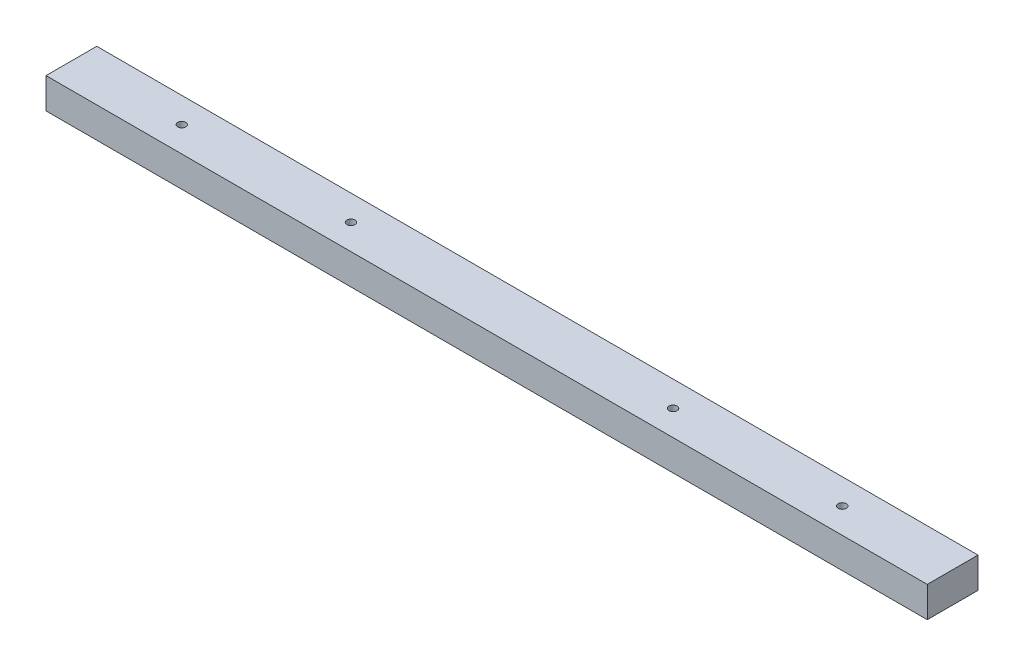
ISO-10303-21;
HEADER;
FILE_DESCRIPTION(('STEP AP214'),'2;1');
FILE_NAME('part.step','',(''),(''),'','','');
FILE_SCHEMA(('AUTOMOTIVE_DESIGN { 1 0 10303 214 1 1 1 1 }'));
ENDSEC;
DATA;
#1=APPLICATION_CONTEXT('core data for automotive mechanical design processes');
#2=APPLICATION_PROTOCOL_DEFINITION('international standard','automotive_design',2000,#1);
#3=PRODUCT_CONTEXT('',#1,'mechanical');
#4=PRODUCT('Part','Part','',(#3));
#5=PRODUCT_RELATED_PRODUCT_CATEGORY('part','',(#4));
#6=PRODUCT_DEFINITION_FORMATION('','',#4);
#7=PRODUCT_DEFINITION_CONTEXT('part definition',#1,'design');
#8=PRODUCT_DEFINITION('design','',#6,#7);
#9=PRODUCT_DEFINITION_SHAPE('','',#8);
#10=(LENGTH_UNIT() NAMED_UNIT(*) SI_UNIT(.MILLI.,.METRE.));
#11=(NAMED_UNIT(*) PLANE_ANGLE_UNIT() SI_UNIT($,.RADIAN.));
#12=(NAMED_UNIT(*) SI_UNIT($,.STERADIAN.) SOLID_ANGLE_UNIT());
#13=UNCERTAINTY_MEASURE_WITH_UNIT(LENGTH_MEASURE(1.E-05),#10,'distance_accuracy_value','');
#14=(GEOMETRIC_REPRESENTATION_CONTEXT(3) GLOBAL_UNCERTAINTY_ASSIGNED_CONTEXT((#13)) GLOBAL_UNIT_ASSIGNED_CONTEXT((#10,
#11,#12)) REPRESENTATION_CONTEXT('',''));
#15=CARTESIAN_POINT('',(0.,0.,0.));
#16=DIRECTION('',(0.,0.,1.));
#17=DIRECTION('',(1.,0.,0.));
#18=AXIS2_PLACEMENT_3D('',#15,#16,#17);
#19=CARTESIAN_POINT('',(0.,38.,0.));
#20=DIRECTION('',(0.,0.,-1.));
#21=DIRECTION('',(-1.,0.,0.));
#22=AXIS2_PLACEMENT_3D('',#19,#20,#21);
#23=PLANE('',#22);
#24=DIRECTION('',(1.,0.,0.));
#25=VECTOR('',#24,1.);
#26=CARTESIAN_POINT('',(0.,38.,0.));
#27=LINE('',#26,#25);
#28=CARTESIAN_POINT('',(63.,38.,0.));
#29=VERTEX_POINT('',#28);
#30=CARTESIAN_POINT('',(1157.,38.,-1.3397635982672E-13));
#31=VERTEX_POINT('',#30);
#32=EDGE_CURVE('E40',#29,#31,#27,.T.);
#33=ORIENTED_EDGE('',*,*,#32,.F.);
#34=DIRECTION('',(0.,1.,0.));
#35=VECTOR('',#34,1.);
#36=CARTESIAN_POINT('',(63.,-0.001000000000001,0.));
#37=LINE('',#36,#35);
#38=CARTESIAN_POINT('',(63.,0.,0.));
#39=VERTEX_POINT('',#38);
#40=EDGE_CURVE('E72',#39,#29,#37,.T.);
#41=ORIENTED_EDGE('',*,*,#40,.F.);
#42=DIRECTION('',(1.,0.,0.));
#43=VECTOR('',#42,1.);
#44=CARTESIAN_POINT('',(0.,0.,0.));
#45=LINE('',#44,#43);
#46=CARTESIAN_POINT('',(1157.,0.,0.));
#47=VERTEX_POINT('',#46);
#48=EDGE_CURVE('E90',#39,#47,#45,.T.);
#49=ORIENTED_EDGE('',*,*,#48,.T.);
#50=DIRECTION('',(0.,1.,0.));
#51=VECTOR('',#50,1.);
#52=CARTESIAN_POINT('',(1157.,-0.001000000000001,-1.3397635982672E-13));
#53=LINE('',#52,#51);
#54=EDGE_CURVE('E48',#47,#31,#53,.T.);
#55=ORIENTED_EDGE('',*,*,#54,.T.);
#56=EDGE_LOOP('',(#33,#41,#49,#55));
#57=FACE_BOUND('',#56,.T.);
#58=ADVANCED_FACE('F32',(#57),#23,.F.);
#59=CARTESIAN_POINT('',(0.,38.,-63.));
#60=DIRECTION('',(0.,0.,1.));
#61=DIRECTION('',(1.,0.,0.));
#62=AXIS2_PLACEMENT_3D('',#59,#60,#61);
#63=PLANE('',#62);
#64=DIRECTION('',(-1.,0.,0.));
#65=VECTOR('',#64,1.);
#66=CARTESIAN_POINT('',(0.,0.,-63.));
#67=LINE('',#66,#65);
#68=CARTESIAN_POINT('',(1157.,0.,-63.0000000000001));
#69=VERTEX_POINT('',#68);
#70=CARTESIAN_POINT('',(63.,0.,-63.));
#71=VERTEX_POINT('',#70);
#72=EDGE_CURVE('E35',#69,#71,#67,.T.);
#73=ORIENTED_EDGE('',*,*,#72,.T.);
#74=DIRECTION('',(0.,1.,0.));
#75=VECTOR('',#74,1.);
#76=CARTESIAN_POINT('',(63.,-0.001000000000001,-63.));
#77=LINE('',#76,#75);
#78=CARTESIAN_POINT('',(63.,38.,-63.));
#79=VERTEX_POINT('',#78);
#80=EDGE_CURVE('E56',#71,#79,#77,.T.);
#81=ORIENTED_EDGE('',*,*,#80,.T.);
#82=DIRECTION('',(-1.,0.,0.));
#83=VECTOR('',#82,1.);
#84=CARTESIAN_POINT('',(0.,38.,-63.));
#85=LINE('',#84,#83);
#86=CARTESIAN_POINT('',(1157.,38.,-63.0000000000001));
#87=VERTEX_POINT('',#86);
#88=EDGE_CURVE('E11',#87,#79,#85,.T.);
#89=ORIENTED_EDGE('',*,*,#88,.F.);
#90=DIRECTION('',(0.,1.,0.));
#91=VECTOR('',#90,1.);
#92=CARTESIAN_POINT('',(1157.,-0.001000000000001,-63.0000000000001));
#93=LINE('',#92,#91);
#94=EDGE_CURVE('E104',#69,#87,#93,.T.);
#95=ORIENTED_EDGE('',*,*,#94,.F.);
#96=EDGE_LOOP('',(#73,#81,#89,#95));
#97=FACE_BOUND('',#96,.T.);
#98=ADVANCED_FACE('F134',(#97),#63,.F.);
#99=CARTESIAN_POINT('',(0.,38.,0.));
#100=DIRECTION('',(0.,-1.,0.));
#101=DIRECTION('',(0.,0.,-1.));
#102=AXIS2_PLACEMENT_3D('',#99,#100,#101);
#103=PLANE('',#102);
#104=CARTESIAN_POINT('',(200.,38.,-31.5));
#105=DIRECTION('',(0.,1.,0.));
#106=DIRECTION('',(0.,0.,1.));
#107=AXIS2_PLACEMENT_3D('',#104,#105,#106);
#108=CIRCLE('',#107,4.99999999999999);
#109=CARTESIAN_POINT('',(200.,38.,-26.5));
#110=VERTEX_POINT('',#109);
#111=EDGE_CURVE('E96',#110,#110,#108,.T.);
#112=ORIENTED_EDGE('',*,*,#111,.F.);
#113=EDGE_LOOP('',(#112));
#114=FACE_BOUND('',#113,.T.);
#115=CARTESIAN_POINT('',(410.,38.,-31.5));
#116=DIRECTION('',(0.,1.,0.));
#117=DIRECTION('',(0.,0.,1.));
#118=AXIS2_PLACEMENT_3D('',#115,#116,#117);
#119=CIRCLE('',#118,5.00000000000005);
#120=CARTESIAN_POINT('',(410.,38.,-26.5));
#121=VERTEX_POINT('',#120);
#122=EDGE_CURVE('E109',#121,#121,#119,.T.);
#123=ORIENTED_EDGE('',*,*,#122,.F.);
#124=EDGE_LOOP('',(#123));
#125=FACE_BOUND('',#124,.T.);
#126=CARTESIAN_POINT('',(810.,38.,-31.5));
#127=DIRECTION('',(0.,1.,0.));
#128=DIRECTION('',(0.,0.,-1.));
#129=AXIS2_PLACEMENT_3D('',#126,#127,#128);
#130=CIRCLE('',#129,5.00000000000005);
#131=CARTESIAN_POINT('',(810.,38.,-36.5));
#132=VERTEX_POINT('',#131);
#133=EDGE_CURVE('E115',#132,#132,#130,.T.);
#134=ORIENTED_EDGE('',*,*,#133,.F.);
#135=EDGE_LOOP('',(#134));
#136=FACE_BOUND('',#135,.T.);
#137=CARTESIAN_POINT('',(1020.,38.,-31.5000000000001));
#138=DIRECTION('',(0.,1.,0.));
#139=DIRECTION('',(0.,0.,-1.));
#140=AXIS2_PLACEMENT_3D('',#137,#138,#139);
#141=CIRCLE('',#140,5.00000000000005);
#142=CARTESIAN_POINT('',(1020.,38.,-36.5000000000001));
#143=VERTEX_POINT('',#142);
#144=EDGE_CURVE('E92',#143,#143,#141,.T.);
#145=ORIENTED_EDGE('',*,*,#144,.F.);
#146=EDGE_LOOP('',(#145));
#147=FACE_BOUND('',#146,.T.);
#148=ORIENTED_EDGE('',*,*,#88,.T.);
#149=DIRECTION('',(0.,0.,-1.));
#150=VECTOR('',#149,1.);
#151=CARTESIAN_POINT('',(63.,38.,0.));
#152=LINE('',#151,#150);
#153=EDGE_CURVE('E75',#29,#79,#152,.T.);
#154=ORIENTED_EDGE('',*,*,#153,.F.);
#155=ORIENTED_EDGE('',*,*,#32,.T.);
#156=DIRECTION('',(0.,0.,1.));
#157=VECTOR('',#156,1.);
#158=CARTESIAN_POINT('',(1157.,38.,-1.3397635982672E-13));
#159=LINE('',#158,#157);
#160=EDGE_CURVE('E130',#87,#31,#159,.T.);
#161=ORIENTED_EDGE('',*,*,#160,.F.);
#162=EDGE_LOOP('',(#148,#154,#155,#161));
#163=FACE_BOUND('',#162,.T.);
#164=ADVANCED_FACE('F84',(#114,#125,#136,#147,#163),#103,.F.);
#165=CARTESIAN_POINT('',(0.,0.,0.));
#166=DIRECTION('',(0.,-1.,0.));
#167=DIRECTION('',(0.,0.,-1.));
#168=AXIS2_PLACEMENT_3D('',#165,#166,#167);
#169=PLANE('',#168);
#170=DIRECTION('',(0.,0.,-1.));
#171=VECTOR('',#170,1.);
#172=CARTESIAN_POINT('',(63.,0.,0.));
#173=LINE('',#172,#171);
#174=EDGE_CURVE('E76',#39,#71,#173,.T.);
#175=ORIENTED_EDGE('',*,*,#174,.T.);
#176=ORIENTED_EDGE('',*,*,#72,.F.);
#177=DIRECTION('',(0.,0.,1.));
#178=VECTOR('',#177,1.);
#179=CARTESIAN_POINT('',(1157.,0.,-1.3397635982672E-13));
#180=LINE('',#179,#178);
#181=EDGE_CURVE('E128',#69,#47,#180,.T.);
#182=ORIENTED_EDGE('',*,*,#181,.T.);
#183=ORIENTED_EDGE('',*,*,#48,.F.);
#184=EDGE_LOOP('',(#175,#176,#182,#183));
#185=FACE_BOUND('',#184,.T.);
#186=CARTESIAN_POINT('',(200.,0.,-31.5));
#187=DIRECTION('',(0.,1.,0.));
#188=DIRECTION('',(0.,0.,1.));
#189=AXIS2_PLACEMENT_3D('',#186,#187,#188);
#190=CIRCLE('',#189,4.99999999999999);
#191=CARTESIAN_POINT('',(200.,0.,-26.5));
#192=VERTEX_POINT('',#191);
#193=EDGE_CURVE('E94',#192,#192,#190,.T.);
#194=ORIENTED_EDGE('',*,*,#193,.T.);
#195=EDGE_LOOP('',(#194));
#196=FACE_BOUND('',#195,.T.);
#197=CARTESIAN_POINT('',(410.,0.,-31.5));
#198=DIRECTION('',(0.,1.,0.));
#199=DIRECTION('',(0.,0.,1.));
#200=AXIS2_PLACEMENT_3D('',#197,#198,#199);
#201=CIRCLE('',#200,5.00000000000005);
#202=CARTESIAN_POINT('',(410.,0.,-26.5));
#203=VERTEX_POINT('',#202);
#204=EDGE_CURVE('E101',#203,#203,#201,.T.);
#205=ORIENTED_EDGE('',*,*,#204,.T.);
#206=EDGE_LOOP('',(#205));
#207=FACE_BOUND('',#206,.T.);
#208=CARTESIAN_POINT('',(810.,0.,-31.5));
#209=DIRECTION('',(0.,1.,0.));
#210=DIRECTION('',(0.,0.,-1.));
#211=AXIS2_PLACEMENT_3D('',#208,#209,#210);
#212=CIRCLE('',#211,5.00000000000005);
#213=CARTESIAN_POINT('',(810.,0.,-36.5));
#214=VERTEX_POINT('',#213);
#215=EDGE_CURVE('E112',#214,#214,#212,.T.);
#216=ORIENTED_EDGE('',*,*,#215,.T.);
#217=EDGE_LOOP('',(#216));
#218=FACE_BOUND('',#217,.T.);
#219=CARTESIAN_POINT('',(1020.,0.,-31.5000000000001));
#220=DIRECTION('',(0.,1.,0.));
#221=DIRECTION('',(0.,0.,-1.));
#222=AXIS2_PLACEMENT_3D('',#219,#220,#221);
#223=CIRCLE('',#222,5.00000000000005);
#224=CARTESIAN_POINT('',(1020.,0.,-36.5000000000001));
#225=VERTEX_POINT('',#224);
#226=EDGE_CURVE('E117',#225,#225,#223,.T.);
#227=ORIENTED_EDGE('',*,*,#226,.T.);
#228=EDGE_LOOP('',(#227));
#229=FACE_BOUND('',#228,.T.);
#230=ADVANCED_FACE('F140',(#185,#196,#207,#218,#229),#169,.T.);
#231=CARTESIAN_POINT('',(1020.,0.,-31.5000000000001));
#232=DIRECTION('',(0.,1.,0.));
#233=DIRECTION('',(0.,0.,1.));
#234=AXIS2_PLACEMENT_3D('',#231,#232,#233);
#235=CYLINDRICAL_SURFACE('',#234,5.00000000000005);
#236=ORIENTED_EDGE('',*,*,#226,.F.);
#237=EDGE_LOOP('',(#236));
#238=FACE_BOUND('',#237,.T.);
#239=ORIENTED_EDGE('',*,*,#144,.T.);
#240=EDGE_LOOP('',(#239));
#241=FACE_BOUND('',#240,.T.);
#242=ADVANCED_FACE('F145',(#238,#241),#235,.F.);
#243=CARTESIAN_POINT('',(810.,0.,-31.5));
#244=DIRECTION('',(0.,1.,0.));
#245=DIRECTION('',(0.,0.,1.));
#246=AXIS2_PLACEMENT_3D('',#243,#244,#245);
#247=CYLINDRICAL_SURFACE('',#246,5.00000000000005);
#248=ORIENTED_EDGE('',*,*,#215,.F.);
#249=EDGE_LOOP('',(#248));
#250=FACE_BOUND('',#249,.T.);
#251=ORIENTED_EDGE('',*,*,#133,.T.);
#252=EDGE_LOOP('',(#251));
#253=FACE_BOUND('',#252,.T.);
#254=ADVANCED_FACE('F150',(#250,#253),#247,.F.);
#255=CARTESIAN_POINT('',(410.,0.,-31.5));
#256=DIRECTION('',(0.,1.,0.));
#257=DIRECTION('',(0.,0.,1.));
#258=AXIS2_PLACEMENT_3D('',#255,#256,#257);
#259=CYLINDRICAL_SURFACE('',#258,5.00000000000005);
#260=ORIENTED_EDGE('',*,*,#204,.F.);
#261=EDGE_LOOP('',(#260));
#262=FACE_BOUND('',#261,.T.);
#263=ORIENTED_EDGE('',*,*,#122,.T.);
#264=EDGE_LOOP('',(#263));
#265=FACE_BOUND('',#264,.T.);
#266=ADVANCED_FACE('F154',(#262,#265),#259,.F.);
#267=CARTESIAN_POINT('',(200.,0.,-31.5));
#268=DIRECTION('',(0.,1.,0.));
#269=DIRECTION('',(0.,0.,1.));
#270=AXIS2_PLACEMENT_3D('',#267,#268,#269);
#271=CYLINDRICAL_SURFACE('',#270,4.99999999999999);
#272=ORIENTED_EDGE('',*,*,#193,.F.);
#273=EDGE_LOOP('',(#272));
#274=FACE_BOUND('',#273,.T.);
#275=ORIENTED_EDGE('',*,*,#111,.T.);
#276=EDGE_LOOP('',(#275));
#277=FACE_BOUND('',#276,.T.);
#278=ADVANCED_FACE('F158',(#274,#277),#271,.F.);
#279=CARTESIAN_POINT('',(1157.,-0.001000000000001,-1.3397635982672E-13));
#280=DIRECTION('',(-1.,0.,0.));
#281=DIRECTION('',(0.,0.,1.));
#282=AXIS2_PLACEMENT_3D('',#279,#280,#281);
#283=PLANE('',#282);
#284=ORIENTED_EDGE('',*,*,#94,.T.);
#285=ORIENTED_EDGE('',*,*,#160,.T.);
#286=ORIENTED_EDGE('',*,*,#54,.F.);
#287=ORIENTED_EDGE('',*,*,#181,.F.);
#288=EDGE_LOOP('',(#284,#285,#286,#287));
#289=FACE_BOUND('',#288,.T.);
#290=ADVANCED_FACE('F132',(#289),#283,.F.);
#291=CARTESIAN_POINT('',(63.,-0.001000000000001,0.));
#292=DIRECTION('',(1.,0.,0.));
#293=DIRECTION('',(0.,0.,-1.));
#294=AXIS2_PLACEMENT_3D('',#291,#292,#293);
#295=PLANE('',#294);
#296=ORIENTED_EDGE('',*,*,#40,.T.);
#297=ORIENTED_EDGE('',*,*,#153,.T.);
#298=ORIENTED_EDGE('',*,*,#80,.F.);
#299=ORIENTED_EDGE('',*,*,#174,.F.);
#300=EDGE_LOOP('',(#296,#297,#298,#299));
#301=FACE_BOUND('',#300,.T.);
#302=ADVANCED_FACE('F74',(#301),#295,.F.);
#303=CLOSED_SHELL('',(#58,#98,#164,#230,#242,#254,#266,#278,#290,#302));
#304=MANIFOLD_SOLID_BREP('B2',#303);
#305=ADVANCED_BREP_SHAPE_REPRESENTATION('',(#18,#304),#14);
#306=SHAPE_DEFINITION_REPRESENTATION(#9,#305);
ENDSEC;
END-ISO-10303-21;
